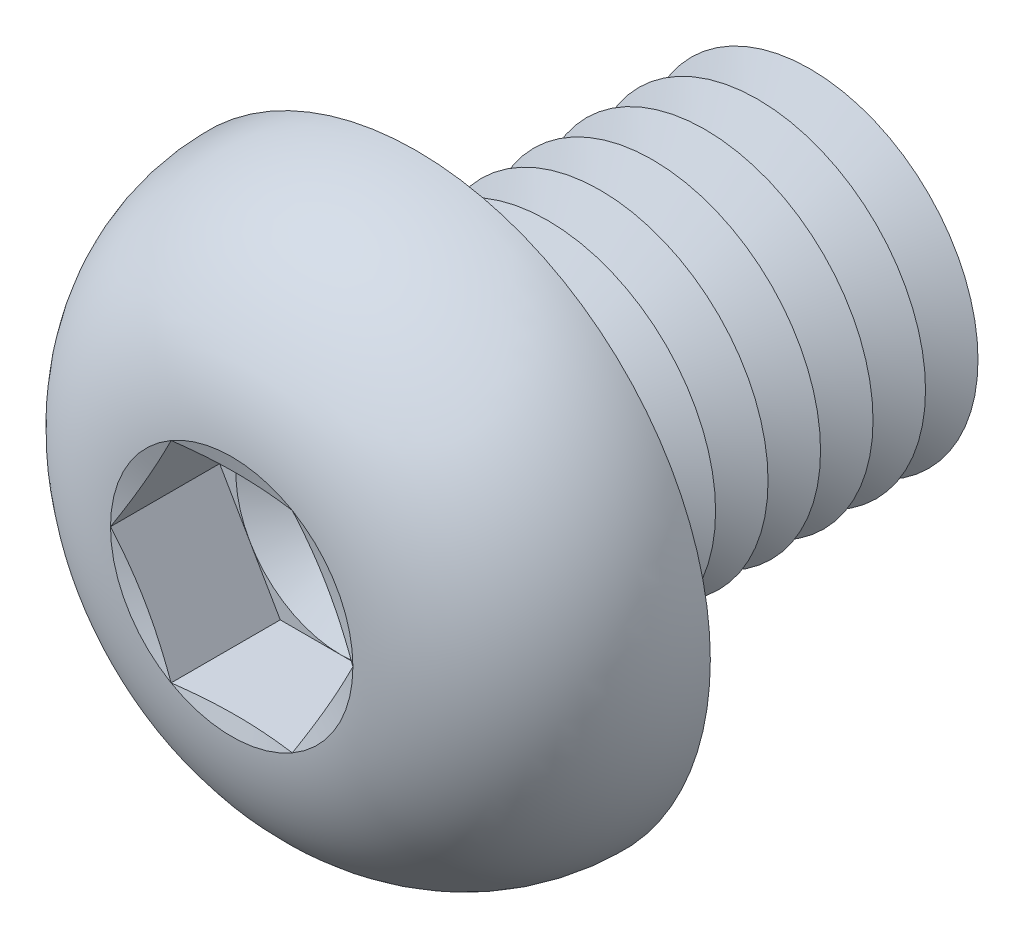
ISO-10303-21;
HEADER;
FILE_DESCRIPTION(('STEP AP214'),'2;1');
FILE_NAME('part.step','',(''),(''),'','','');
FILE_SCHEMA(('AUTOMOTIVE_DESIGN { 1 0 10303 214 1 1 1 1 }'));
ENDSEC;
DATA;
#1=APPLICATION_CONTEXT('core data for automotive mechanical design processes');
#2=APPLICATION_PROTOCOL_DEFINITION('international standard','automotive_design',2000,#1);
#3=PRODUCT_CONTEXT('',#1,'mechanical');
#4=PRODUCT('Part','Part','',(#3));
#5=PRODUCT_RELATED_PRODUCT_CATEGORY('part','',(#4));
#6=PRODUCT_DEFINITION_FORMATION('','',#4);
#7=PRODUCT_DEFINITION_CONTEXT('part definition',#1,'design');
#8=PRODUCT_DEFINITION('design','',#6,#7);
#9=PRODUCT_DEFINITION_SHAPE('','',#8);
#10=(LENGTH_UNIT() NAMED_UNIT(*) SI_UNIT(.MILLI.,.METRE.));
#11=(NAMED_UNIT(*) PLANE_ANGLE_UNIT() SI_UNIT($,.RADIAN.));
#12=(NAMED_UNIT(*) SI_UNIT($,.STERADIAN.) SOLID_ANGLE_UNIT());
#13=UNCERTAINTY_MEASURE_WITH_UNIT(LENGTH_MEASURE(1.E-05),#10,'distance_accuracy_value','');
#14=(GEOMETRIC_REPRESENTATION_CONTEXT(3) GLOBAL_UNCERTAINTY_ASSIGNED_CONTEXT((#13)) GLOBAL_UNIT_ASSIGNED_CONTEXT((#10,
#11,#12)) REPRESENTATION_CONTEXT('',''));
#15=CARTESIAN_POINT('',(0.,0.,0.));
#16=DIRECTION('',(0.,0.,1.));
#17=DIRECTION('',(1.,0.,0.));
#18=AXIS2_PLACEMENT_3D('',#15,#16,#17);
#19=CARTESIAN_POINT('',(0.,0.,1.8));
#20=DIRECTION('',(0.,0.,1.));
#21=DIRECTION('',(1.,0.,0.));
#22=AXIS2_PLACEMENT_3D('',#19,#20,#21);
#23=PLANE('',#22);
#24=CARTESIAN_POINT('',(0.,0.,1.8));
#25=DIRECTION('',(0.,0.,1.));
#26=DIRECTION('',(1.,0.,0.));
#27=AXIS2_PLACEMENT_3D('',#24,#25,#26);
#28=CIRCLE('',#27,2.49999883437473);
#29=CARTESIAN_POINT('',(2.1650625,1.24999941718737,1.8));
#30=VERTEX_POINT('',#29);
#31=CARTESIAN_POINT('',(0.,2.49999883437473,1.8));
#32=VERTEX_POINT('',#31);
#33=EDGE_CURVE('E118',#30,#32,#28,.T.);
#34=ORIENTED_EDGE('',*,*,#33,.F.);
#35=DIRECTION('',(-0.5,0.866025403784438,0.));
#36=VECTOR('',#35,1.);
#37=CARTESIAN_POINT('',(2.88675000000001,0.,1.8));
#38=LINE('',#37,#36);
#39=CARTESIAN_POINT('',(1.443375,2.49999883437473,1.8));
#40=VERTEX_POINT('',#39);
#41=EDGE_CURVE('E125',#30,#40,#38,.T.);
#42=ORIENTED_EDGE('',*,*,#41,.T.);
#43=DIRECTION('',(-1.,0.,0.));
#44=VECTOR('',#43,1.);
#45=CARTESIAN_POINT('',(1.443375,2.49999883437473,1.8));
#46=LINE('',#45,#44);
#47=EDGE_CURVE('E136',#40,#32,#46,.T.);
#48=ORIENTED_EDGE('',*,*,#47,.T.);
#49=EDGE_LOOP('',(#34,#42,#48));
#50=FACE_BOUND('',#49,.T.);
#51=ADVANCED_FACE('F39',(#50),#23,.T.);
#52=CARTESIAN_POINT('',(0.,0.,1.8));
#53=DIRECTION('',(0.,0.,1.));
#54=DIRECTION('',(1.,0.,0.));
#55=AXIS2_PLACEMENT_3D('',#52,#53,#54);
#56=CIRCLE('',#55,2.49999883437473);
#57=CARTESIAN_POINT('',(-2.1650625,1.24999941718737,1.8));
#58=VERTEX_POINT('',#57);
#59=EDGE_CURVE('E11',#32,#58,#56,.T.);
#60=ORIENTED_EDGE('',*,*,#59,.F.);
#61=CARTESIAN_POINT('',(-1.443375,2.49999883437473,1.8));
#62=VERTEX_POINT('',#61);
#63=EDGE_CURVE('E131',#32,#62,#46,.T.);
#64=ORIENTED_EDGE('',*,*,#63,.T.);
#65=DIRECTION('',(-0.5,-0.866025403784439,0.));
#66=VECTOR('',#65,1.);
#67=CARTESIAN_POINT('',(-1.443375,2.49999883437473,1.8));
#68=LINE('',#67,#66);
#69=EDGE_CURVE('E134',#62,#58,#68,.T.);
#70=ORIENTED_EDGE('',*,*,#69,.T.);
#71=EDGE_LOOP('',(#60,#64,#70));
#72=FACE_BOUND('',#71,.T.);
#73=ADVANCED_FACE('F130',(#72),#23,.T.);
#74=CARTESIAN_POINT('',(-2.1650625,-1.24999941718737,1.8));
#75=VERTEX_POINT('',#74);
#76=EDGE_CURVE('E49',#58,#75,#56,.T.);
#77=ORIENTED_EDGE('',*,*,#76,.F.);
#78=CARTESIAN_POINT('',(-2.88675000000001,0.,1.8));
#79=VERTEX_POINT('',#78);
#80=EDGE_CURVE('E143',#58,#79,#68,.T.);
#81=ORIENTED_EDGE('',*,*,#80,.T.);
#82=DIRECTION('',(0.5,-0.866025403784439,0.));
#83=VECTOR('',#82,1.);
#84=CARTESIAN_POINT('',(-2.88675000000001,0.,1.8));
#85=LINE('',#84,#83);
#86=EDGE_CURVE('E152',#79,#75,#85,.T.);
#87=ORIENTED_EDGE('',*,*,#86,.T.);
#88=EDGE_LOOP('',(#77,#81,#87));
#89=FACE_BOUND('',#88,.T.);
#90=ADVANCED_FACE('F332',(#89),#23,.T.);
#91=CARTESIAN_POINT('',(0.,-2.49999883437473,1.8));
#92=VERTEX_POINT('',#91);
#93=EDGE_CURVE('E316',#75,#92,#56,.T.);
#94=ORIENTED_EDGE('',*,*,#93,.F.);
#95=CARTESIAN_POINT('',(-1.443375,-2.49999883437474,1.8));
#96=VERTEX_POINT('',#95);
#97=EDGE_CURVE('E151',#75,#96,#85,.T.);
#98=ORIENTED_EDGE('',*,*,#97,.T.);
#99=DIRECTION('',(1.,0.,0.));
#100=VECTOR('',#99,1.);
#101=CARTESIAN_POINT('',(-1.443375,-2.49999883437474,1.8));
#102=LINE('',#101,#100);
#103=EDGE_CURVE('E157',#96,#92,#102,.T.);
#104=ORIENTED_EDGE('',*,*,#103,.T.);
#105=EDGE_LOOP('',(#94,#98,#104));
#106=FACE_BOUND('',#105,.T.);
#107=ADVANCED_FACE('F325',(#106),#23,.T.);
#108=CARTESIAN_POINT('',(2.16506250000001,-1.24999941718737,1.8));
#109=VERTEX_POINT('',#108);
#110=EDGE_CURVE('E56',#92,#109,#56,.T.);
#111=ORIENTED_EDGE('',*,*,#110,.F.);
#112=CARTESIAN_POINT('',(1.443375,-2.49999883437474,1.8));
#113=VERTEX_POINT('',#112);
#114=EDGE_CURVE('E156',#92,#113,#102,.T.);
#115=ORIENTED_EDGE('',*,*,#114,.T.);
#116=DIRECTION('',(0.5,0.866025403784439,0.));
#117=VECTOR('',#116,1.);
#118=CARTESIAN_POINT('',(1.443375,-2.49999883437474,1.8));
#119=LINE('',#118,#117);
#120=EDGE_CURVE('E162',#113,#109,#119,.T.);
#121=ORIENTED_EDGE('',*,*,#120,.T.);
#122=EDGE_LOOP('',(#111,#115,#121));
#123=FACE_BOUND('',#122,.T.);
#124=ADVANCED_FACE('F401',(#123),#23,.T.);
#125=CARTESIAN_POINT('',(0.,0.,4.4));
#126=DIRECTION('',(0.,0.,1.));
#127=DIRECTION('',(0.,-1.,0.));
#128=AXIS2_PLACEMENT_3D('',#125,#126,#127);
#129=CONICAL_SURFACE('',#128,2.88675000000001,1.30899693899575);
#130=CARTESIAN_POINT('',(2.88686547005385,-0.000200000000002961,4.40003094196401));
#131=CARTESIAN_POINT('',(2.82691617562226,0.103635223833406,4.3839595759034));
#132=CARTESIAN_POINT('',(2.7668581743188,0.20765873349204,4.36936933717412));
#133=CARTESIAN_POINT('',(2.64653003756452,0.416073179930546,4.3437355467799));
#134=CARTESIAN_POINT('',(2.58625982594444,0.520464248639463,4.33269343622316));
#135=CARTESIAN_POINT('',(2.46587274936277,0.728980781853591,4.31480063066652));
#136=CARTESIAN_POINT('',(2.40575669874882,0.833104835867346,4.3079285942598));
#137=CARTESIAN_POINT('',(2.28544792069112,1.0414857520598,4.29871388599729));
#138=CARTESIAN_POINT('',(2.22525521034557,1.14574258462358,4.29637033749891));
#139=CARTESIAN_POINT('',(2.10486978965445,1.35425624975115,4.29637033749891));
#140=CARTESIAN_POINT('',(2.04467707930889,1.45851308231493,4.29871388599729));
#141=CARTESIAN_POINT('',(1.9243683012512,1.66689399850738,4.3079285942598));
#142=CARTESIAN_POINT('',(1.86425225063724,1.77101805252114,4.31480063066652));
#143=CARTESIAN_POINT('',(1.74386517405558,1.97953458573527,4.33269343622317));
#144=CARTESIAN_POINT('',(1.68359496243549,2.08392565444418,4.3437355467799));
#145=CARTESIAN_POINT('',(1.56326682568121,2.29234010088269,4.36936933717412));
#146=CARTESIAN_POINT('',(1.50320882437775,2.39636361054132,4.3839595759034));
#147=CARTESIAN_POINT('',(1.44325952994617,2.50019883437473,4.40003094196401));
#148=B_SPLINE_CURVE_WITH_KNOTS('',3,(#130,#131,#132,#133,#134,#135,#136,#137,#138,#139,#140,
#141,#142,#143,#144,#145,#146,#147),.UNSPECIFIED.,.F.,.F.,(4,2,2,2,2,2,2,2,4),(0.,
0.362931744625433,0.726010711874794,1.08721550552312,1.44835036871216,1.8094852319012,
2.17069002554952,2.53376899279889,2.89670073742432),.UNSPECIFIED.);
#149=CARTESIAN_POINT('',(2.88675000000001,0.,4.4));
#150=VERTEX_POINT('',#149);
#151=CARTESIAN_POINT('',(1.44337499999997,2.49999883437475,4.4));
#152=VERTEX_POINT('',#151);
#153=EDGE_CURVE('E221',#150,#152,#148,.T.);
#154=ORIENTED_EDGE('',*,*,#153,.F.);
#155=CARTESIAN_POINT('',(0.,0.,4.4));
#156=DIRECTION('',(0.,0.,-1.));
#157=DIRECTION('',(0.,1.,0.));
#158=AXIS2_PLACEMENT_3D('',#155,#156,#157);
#159=CIRCLE('',#158,2.88675000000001);
#160=EDGE_CURVE('E300',#152,#150,#159,.T.);
#161=ORIENTED_EDGE('',*,*,#160,.F.);
#162=EDGE_LOOP('',(#154,#161));
#163=FACE_BOUND('',#162,.T.);
#164=ADVANCED_FACE('F405',(#163),#129,.F.);
#165=CARTESIAN_POINT('',(1.44325952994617,-2.50019883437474,4.400030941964));
#166=CARTESIAN_POINT('',(1.50320882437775,-2.39636361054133,4.3839595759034));
#167=CARTESIAN_POINT('',(1.56326682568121,-2.2923401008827,4.36936933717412));
#168=CARTESIAN_POINT('',(1.68359496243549,-2.08392565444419,4.3437355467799));
#169=CARTESIAN_POINT('',(1.74386517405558,-1.97953458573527,4.33269343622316));
#170=CARTESIAN_POINT('',(1.86425225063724,-1.77101805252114,4.31480063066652));
#171=CARTESIAN_POINT('',(1.9243683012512,-1.66689399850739,4.3079285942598));
#172=CARTESIAN_POINT('',(2.04467707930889,-1.45851308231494,4.29871388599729));
#173=CARTESIAN_POINT('',(2.10486978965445,-1.35425624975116,4.29637033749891));
#174=CARTESIAN_POINT('',(2.22525521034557,-1.14574258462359,4.29637033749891));
#175=CARTESIAN_POINT('',(2.28544792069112,-1.0414857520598,4.29871388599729));
#176=CARTESIAN_POINT('',(2.40575669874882,-0.833104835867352,4.3079285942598));
#177=CARTESIAN_POINT('',(2.46587274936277,-0.728980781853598,4.31480063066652));
#178=CARTESIAN_POINT('',(2.58625982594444,-0.520464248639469,4.33269343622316));
#179=CARTESIAN_POINT('',(2.64653003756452,-0.416073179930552,4.3437355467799));
#180=CARTESIAN_POINT('',(2.7668581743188,-0.207658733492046,4.36936933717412));
#181=CARTESIAN_POINT('',(2.82691617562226,-0.103635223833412,4.3839595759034));
#182=CARTESIAN_POINT('',(2.88686547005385,0.000199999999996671,4.40003094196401));
#183=B_SPLINE_CURVE_WITH_KNOTS('',3,(#165,#166,#167,#168,#169,#170,#171,#172,#173,#174,#175,
#176,#177,#178,#179,#180,#181,#182),.UNSPECIFIED.,.F.,.F.,(4,2,2,2,2,2,2,2,4),(0.,
0.362931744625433,0.726010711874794,1.08721550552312,1.44835036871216,1.8094852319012,
2.17069002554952,2.53376899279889,2.89670073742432),.UNSPECIFIED.);
#184=CARTESIAN_POINT('',(1.443375,-2.49999883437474,4.4));
#185=VERTEX_POINT('',#184);
#186=EDGE_CURVE('E230',#185,#150,#183,.T.);
#187=ORIENTED_EDGE('',*,*,#186,.F.);
#188=EDGE_CURVE('E304',#150,#185,#159,.T.);
#189=ORIENTED_EDGE('',*,*,#188,.F.);
#190=EDGE_LOOP('',(#187,#189));
#191=FACE_BOUND('',#190,.T.);
#192=ADVANCED_FACE('F367',(#191),#129,.F.);
#193=CARTESIAN_POINT('',(-4.35611719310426,-2.49999883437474,4.97227902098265));
#194=CARTESIAN_POINT('',(-4.25066509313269,-2.49999883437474,4.94777440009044));
#195=CARTESIAN_POINT('',(-4.14516541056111,-2.49999883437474,4.92347459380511));
#196=CARTESIAN_POINT('',(-3.93405094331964,-2.49999883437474,4.87537247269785));
#197=CARTESIAN_POINT('',(-3.8284361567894,-2.49999883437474,4.85157016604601));
#198=CARTESIAN_POINT('',(-3.51135349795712,-2.49999883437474,4.78103338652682));
#199=CARTESIAN_POINT('',(-3.29968815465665,-2.49999883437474,4.73517861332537));
#200=CARTESIAN_POINT('',(-2.8736552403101,-2.49999883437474,4.6464558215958));
#201=CARTESIAN_POINT('',(-2.65928093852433,-2.49999883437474,4.60361983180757));
#202=CARTESIAN_POINT('',(-2.22952626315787,-2.49999883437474,4.52311285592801));
#203=CARTESIAN_POINT('',(-2.01414580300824,-2.49999883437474,4.48544232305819));
#204=CARTESIAN_POINT('',(-1.58798319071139,-2.49999883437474,4.4187655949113));
#205=CARTESIAN_POINT('',(-1.37723418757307,-2.49999883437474,4.3895526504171));
#206=CARTESIAN_POINT('',(-0.954530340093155,-2.49999883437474,4.34171384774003));
#207=CARTESIAN_POINT('',(-0.742575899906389,-2.49999883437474,4.32308463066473));
#208=CARTESIAN_POINT('',(-0.424544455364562,-2.49999883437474,4.30539140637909));
#209=CARTESIAN_POINT('',(-0.318745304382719,-2.49999883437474,4.30120018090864));
#210=CARTESIAN_POINT('',(-0.107062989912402,-2.49999883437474,4.29638997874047));
#211=CARTESIAN_POINT('',(-0.00117982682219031,-2.49999883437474,4.29577098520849));
#212=CARTESIAN_POINT('',(0.210552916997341,-2.49999883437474,4.29814378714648));
#213=CARTESIAN_POINT('',(0.316402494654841,-2.49999883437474,4.30113585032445));
#214=CARTESIAN_POINT('',(0.52794413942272,-2.49999883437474,4.31057322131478));
#215=CARTESIAN_POINT('',(0.633636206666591,-2.49999883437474,4.31701852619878));
#216=CARTESIAN_POINT('',(0.890304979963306,-2.49999883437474,4.33652018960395));
#217=CARTESIAN_POINT('',(1.0411561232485,-2.49999883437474,4.35122885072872));
#218=CARTESIAN_POINT('',(1.34222474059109,-2.49999883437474,4.38593609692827));
#219=CARTESIAN_POINT('',(1.49244223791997,-2.49999883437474,4.40593448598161));
#220=CARTESIAN_POINT('',(1.79273634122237,-2.49999883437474,4.450113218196));
#221=CARTESIAN_POINT('',(1.94281100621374,-2.49999883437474,4.47430656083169));
#222=CARTESIAN_POINT('',(2.24242097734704,-2.49999883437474,4.52583552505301));
#223=CARTESIAN_POINT('',(2.39195625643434,-2.49999883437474,4.55317130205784));
#224=CARTESIAN_POINT('',(2.69364402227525,-2.49999883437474,4.61079781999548));
#225=CARTESIAN_POINT('',(2.84578703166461,-2.49999883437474,4.64113779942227));
#226=CARTESIAN_POINT('',(3.14969016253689,-2.49999883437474,4.70367638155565));
#227=CARTESIAN_POINT('',(3.30145027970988,-2.49999883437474,4.73587500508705));
#228=CARTESIAN_POINT('',(3.6038376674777,-2.49999883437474,4.80150275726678));
#229=CARTESIAN_POINT('',(3.75446660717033,-2.49999883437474,4.83492423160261));
#230=CARTESIAN_POINT('',(4.0554675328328,-2.49999883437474,4.90285814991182));
#231=CARTESIAN_POINT('',(4.20583953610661,-2.49999883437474,4.93737051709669));
#232=CARTESIAN_POINT('',(4.35611719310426,-2.49999883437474,4.97227902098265));
#233=B_SPLINE_CURVE_WITH_KNOTS('',3,(#193,#194,#195,#196,#197,#198,#199,#200,#201,#202,#203,
#204,#205,#206,#207,#208,#209,#210,#211,#212,#213,#214,#215,#216,#217,#218,#219,#220,#221,#222,
#223,#224,#225,#226,#227,#228,#229,#230,#231,#232),.UNSPECIFIED.,.F.,.F.,(4,2,2,2,2,2,2,2,2,2,2,
2,2,2,2,2,2,2,2,4),(0.,0.324785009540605,0.649575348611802,1.29928181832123,1.95507889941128,
2.61093348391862,3.2490528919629,3.8869696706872,4.20456300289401,4.52215483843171,
4.83977022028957,5.15738533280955,5.61196030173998,6.06651842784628,6.5225111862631,
6.97852650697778,7.4439273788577,7.90933346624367,8.37220553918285,8.83504510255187),.UNSPECIFIED.);
#234=CARTESIAN_POINT('',(-1.443375,-2.49999883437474,4.4));
#235=VERTEX_POINT('',#234);
#236=EDGE_CURVE('E345',#235,#185,#233,.T.);
#237=ORIENTED_EDGE('',*,*,#236,.F.);
#238=EDGE_CURVE('E358',#185,#235,#159,.T.);
#239=ORIENTED_EDGE('',*,*,#238,.F.);
#240=EDGE_LOOP('',(#237,#239));
#241=FACE_BOUND('',#240,.T.);
#242=ADVANCED_FACE('F373',(#241),#129,.F.);
#243=CARTESIAN_POINT('',(-2.88686547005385,0.000199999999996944,4.40003094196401));
#244=CARTESIAN_POINT('',(-2.82691617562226,-0.103635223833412,4.3839595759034));
#245=CARTESIAN_POINT('',(-2.7668581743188,-0.207658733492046,4.36936933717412));
#246=CARTESIAN_POINT('',(-2.64653003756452,-0.416073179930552,4.3437355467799));
#247=CARTESIAN_POINT('',(-2.58625982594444,-0.520464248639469,4.33269343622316));
#248=CARTESIAN_POINT('',(-2.46587274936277,-0.728980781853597,4.31480063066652));
#249=CARTESIAN_POINT('',(-2.40575669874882,-0.833104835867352,4.3079285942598));
#250=CARTESIAN_POINT('',(-2.28544792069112,-1.0414857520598,4.29871388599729));
#251=CARTESIAN_POINT('',(-2.22525521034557,-1.14574258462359,4.29637033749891));
#252=CARTESIAN_POINT('',(-2.10486978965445,-1.35425624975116,4.29637033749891));
#253=CARTESIAN_POINT('',(-2.04467707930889,-1.45851308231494,4.29871388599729));
#254=CARTESIAN_POINT('',(-1.9243683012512,-1.66689399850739,4.3079285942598));
#255=CARTESIAN_POINT('',(-1.86425225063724,-1.77101805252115,4.31480063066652));
#256=CARTESIAN_POINT('',(-1.74386517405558,-1.97953458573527,4.33269343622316));
#257=CARTESIAN_POINT('',(-1.68359496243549,-2.08392565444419,4.3437355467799));
#258=CARTESIAN_POINT('',(-1.56326682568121,-2.2923401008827,4.36936933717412));
#259=CARTESIAN_POINT('',(-1.50320882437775,-2.39636361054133,4.3839595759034));
#260=CARTESIAN_POINT('',(-1.44325952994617,-2.50019883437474,4.400030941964));
#261=B_SPLINE_CURVE_WITH_KNOTS('',3,(#243,#244,#245,#246,#247,#248,#249,#250,#251,#252,#253,
#254,#255,#256,#257,#258,#259,#260),.UNSPECIFIED.,.F.,.F.,(4,2,2,2,2,2,2,2,4),(0.,
0.362931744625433,0.726010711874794,1.08721550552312,1.44835036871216,1.8094852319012,
2.17069002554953,2.53376899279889,2.89670073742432),.UNSPECIFIED.);
#262=CARTESIAN_POINT('',(-2.88675000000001,0.,4.4));
#263=VERTEX_POINT('',#262);
#264=EDGE_CURVE('E337',#263,#235,#261,.T.);
#265=ORIENTED_EDGE('',*,*,#264,.F.);
#266=EDGE_CURVE('E343',#235,#263,#159,.T.);
#267=ORIENTED_EDGE('',*,*,#266,.F.);
#268=EDGE_LOOP('',(#265,#267));
#269=FACE_BOUND('',#268,.T.);
#270=ADVANCED_FACE('F341',(#269),#129,.F.);
#271=CARTESIAN_POINT('',(-1.44325952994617,2.50019883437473,4.40003094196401));
#272=CARTESIAN_POINT('',(-1.50320882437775,2.39636361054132,4.3839595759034));
#273=CARTESIAN_POINT('',(-1.56326682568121,2.29234010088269,4.36936933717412));
#274=CARTESIAN_POINT('',(-1.68359496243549,2.08392565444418,4.3437355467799));
#275=CARTESIAN_POINT('',(-1.74386517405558,1.97953458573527,4.33269343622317));
#276=CARTESIAN_POINT('',(-1.86425225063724,1.77101805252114,4.31480063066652));
#277=CARTESIAN_POINT('',(-1.9243683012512,1.66689399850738,4.3079285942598));
#278=CARTESIAN_POINT('',(-2.04467707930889,1.45851308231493,4.29871388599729));
#279=CARTESIAN_POINT('',(-2.10486978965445,1.35425624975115,4.29637033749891));
#280=CARTESIAN_POINT('',(-2.22525521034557,1.14574258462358,4.29637033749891));
#281=CARTESIAN_POINT('',(-2.28544792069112,1.0414857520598,4.29871388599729));
#282=CARTESIAN_POINT('',(-2.40575669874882,0.833104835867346,4.3079285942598));
#283=CARTESIAN_POINT('',(-2.46587274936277,0.728980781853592,4.31480063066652));
#284=CARTESIAN_POINT('',(-2.58625982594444,0.520464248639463,4.33269343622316));
#285=CARTESIAN_POINT('',(-2.64653003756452,0.416073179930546,4.3437355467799));
#286=CARTESIAN_POINT('',(-2.7668581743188,0.20765873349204,4.36936933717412));
#287=CARTESIAN_POINT('',(-2.82691617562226,0.103635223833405,4.3839595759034));
#288=CARTESIAN_POINT('',(-2.88686547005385,-0.000200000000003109,4.40003094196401));
#289=B_SPLINE_CURVE_WITH_KNOTS('',3,(#271,#272,#273,#274,#275,#276,#277,#278,#279,#280,#281,
#282,#283,#284,#285,#286,#287,#288),.UNSPECIFIED.,.F.,.F.,(4,2,2,2,2,2,2,2,4),(0.,
0.362931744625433,0.726010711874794,1.08721550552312,1.44835036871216,1.8094852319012,
2.17069002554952,2.53376899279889,2.89670073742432),.UNSPECIFIED.);
#290=CARTESIAN_POINT('',(-1.443375,2.49999883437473,4.4));
#291=VERTEX_POINT('',#290);
#292=EDGE_CURVE('E195',#291,#263,#289,.T.);
#293=ORIENTED_EDGE('',*,*,#292,.F.);
#294=EDGE_CURVE('E348',#263,#291,#159,.T.);
#295=ORIENTED_EDGE('',*,*,#294,.F.);
#296=EDGE_LOOP('',(#293,#295));
#297=FACE_BOUND('',#296,.T.);
#298=ADVANCED_FACE('F349',(#297),#129,.F.);
#299=CARTESIAN_POINT('',(0.,0.,-5.625));
#300=DIRECTION('',(0.,0.,1.));
#301=DIRECTION('',(0.,-1.,0.));
#302=AXIS2_PLACEMENT_3D('',#299,#300,#301);
#303=CONICAL_SURFACE('',#302,3.99999999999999,1.0471975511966);
#304=CARTESIAN_POINT('',(0.,0.,-6.25));
#305=DIRECTION('',(0.,0.,1.));
#306=DIRECTION('',(0.,-1.,0.));
#307=AXIS2_PLACEMENT_3D('',#304,#305,#306);
#308=CIRCLE('',#307,2.91746824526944);
#309=CARTESIAN_POINT('',(0.,-2.91746824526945,-6.25));
#310=VERTEX_POINT('',#309);
#311=EDGE_CURVE('E271',#310,#310,#308,.T.);
#312=ORIENTED_EDGE('',*,*,#311,.T.);
#313=EDGE_LOOP('',(#312));
#314=FACE_BOUND('',#313,.T.);
#315=CARTESIAN_POINT('',(0.,0.,-5.625));
#316=DIRECTION('',(0.,0.,1.));
#317=DIRECTION('',(0.,-1.,0.));
#318=AXIS2_PLACEMENT_3D('',#315,#316,#317);
#319=CIRCLE('',#318,3.99999999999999);
#320=CARTESIAN_POINT('',(0.,-4.,-5.625));
#321=VERTEX_POINT('',#320);
#322=EDGE_CURVE('E267',#321,#321,#319,.T.);
#323=ORIENTED_EDGE('',*,*,#322,.F.);
#324=EDGE_LOOP('',(#323));
#325=FACE_BOUND('',#324,.T.);
#326=ADVANCED_FACE('F431',(#314,#325),#303,.T.);
#327=CARTESIAN_POINT('',(0.,0.,-6.25));
#328=DIRECTION('',(0.,0.,-1.));
#329=DIRECTION('',(0.,1.,0.));
#330=AXIS2_PLACEMENT_3D('',#327,#328,#329);
#331=CONICAL_SURFACE('',#330,2.91746824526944,1.0471975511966);
#332=CARTESIAN_POINT('',(0.,0.,-6.875));
#333=DIRECTION('',(0.,0.,1.));
#334=DIRECTION('',(0.,-1.,0.));
#335=AXIS2_PLACEMENT_3D('',#332,#333,#334);
#336=CIRCLE('',#335,3.99999999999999);
#337=CARTESIAN_POINT('',(0.,-3.99999999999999,-6.875));
#338=VERTEX_POINT('',#337);
#339=EDGE_CURVE('E275',#338,#338,#336,.T.);
#340=ORIENTED_EDGE('',*,*,#339,.T.);
#341=EDGE_LOOP('',(#340));
#342=FACE_BOUND('',#341,.T.);
#343=ORIENTED_EDGE('',*,*,#311,.F.);
#344=EDGE_LOOP('',(#343));
#345=FACE_BOUND('',#344,.T.);
#346=ADVANCED_FACE('F436',(#342,#345),#331,.T.);
#347=CARTESIAN_POINT('',(0.,3.99999999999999,-9.99999999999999));
#348=DIRECTION('',(0.,0.,-1.));
#349=DIRECTION('',(0.,1.,0.));
#350=AXIS2_PLACEMENT_3D('',#347,#348,#349);
#351=PLANE('',#350);
#352=CARTESIAN_POINT('',(0.,0.,-10.));
#353=DIRECTION('',(0.,0.,1.));
#354=DIRECTION('',(0.,-1.,0.));
#355=AXIS2_PLACEMENT_3D('',#352,#353,#354);
#356=CIRCLE('',#355,2.91746824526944);
#357=CARTESIAN_POINT('',(0.,-2.91746824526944,-10.));
#358=VERTEX_POINT('',#357);
#359=EDGE_CURVE('E295',#358,#358,#356,.T.);
#360=ORIENTED_EDGE('',*,*,#359,.F.);
#361=EDGE_LOOP('',(#360));
#362=FACE_BOUND('',#361,.T.);
#363=ADVANCED_FACE('F603',(#362),#351,.T.);
#364=CARTESIAN_POINT('',(0.,0.,-9.375));
#365=DIRECTION('',(0.,0.,1.));
#366=DIRECTION('',(0.,-1.,0.));
#367=AXIS2_PLACEMENT_3D('',#364,#365,#366);
#368=CONICAL_SURFACE('',#367,3.99999999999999,1.0471975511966);
#369=ORIENTED_EDGE('',*,*,#359,.T.);
#370=EDGE_LOOP('',(#369));
#371=FACE_BOUND('',#370,.T.);
#372=CARTESIAN_POINT('',(0.,0.,-9.375));
#373=DIRECTION('',(0.,0.,1.));
#374=DIRECTION('',(0.,-1.,0.));
#375=AXIS2_PLACEMENT_3D('',#372,#373,#374);
#376=CIRCLE('',#375,3.99999999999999);
#377=CARTESIAN_POINT('',(0.,-3.99999999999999,-9.375));
#378=VERTEX_POINT('',#377);
#379=EDGE_CURVE('E291',#378,#378,#376,.T.);
#380=ORIENTED_EDGE('',*,*,#379,.F.);
#381=EDGE_LOOP('',(#380));
#382=FACE_BOUND('',#381,.T.);
#383=ADVANCED_FACE('F596',(#371,#382),#368,.T.);
#384=CARTESIAN_POINT('',(0.,0.,-8.75));
#385=DIRECTION('',(0.,0.,-1.));
#386=DIRECTION('',(0.,1.,0.));
#387=AXIS2_PLACEMENT_3D('',#384,#385,#386);
#388=CONICAL_SURFACE('',#387,2.91746824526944,1.0471975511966);
#389=ORIENTED_EDGE('',*,*,#379,.T.);
#390=EDGE_LOOP('',(#389));
#391=FACE_BOUND('',#390,.T.);
#392=CARTESIAN_POINT('',(0.,0.,-8.75));
#393=DIRECTION('',(0.,0.,1.));
#394=DIRECTION('',(0.,-1.,0.));
#395=AXIS2_PLACEMENT_3D('',#392,#393,#394);
#396=CIRCLE('',#395,2.91746824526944);
#397=CARTESIAN_POINT('',(0.,-2.91746824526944,-8.75));
#398=VERTEX_POINT('',#397);
#399=EDGE_CURVE('E287',#398,#398,#396,.T.);
#400=ORIENTED_EDGE('',*,*,#399,.F.);
#401=EDGE_LOOP('',(#400));
#402=FACE_BOUND('',#401,.T.);
#403=ADVANCED_FACE('F602',(#391,#402),#388,.T.);
#404=CARTESIAN_POINT('',(0.,0.,-8.125));
#405=DIRECTION('',(0.,0.,1.));
#406=DIRECTION('',(0.,-1.,0.));
#407=AXIS2_PLACEMENT_3D('',#404,#405,#406);
#408=CONICAL_SURFACE('',#407,3.99999999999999,1.0471975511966);
#409=ORIENTED_EDGE('',*,*,#399,.T.);
#410=EDGE_LOOP('',(#409));
#411=FACE_BOUND('',#410,.T.);
#412=CARTESIAN_POINT('',(0.,0.,-8.125));
#413=DIRECTION('',(0.,0.,1.));
#414=DIRECTION('',(0.,-1.,0.));
#415=AXIS2_PLACEMENT_3D('',#412,#413,#414);
#416=CIRCLE('',#415,3.99999999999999);
#417=CARTESIAN_POINT('',(0.,-3.99999999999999,-8.125));
#418=VERTEX_POINT('',#417);
#419=EDGE_CURVE('E283',#418,#418,#416,.T.);
#420=ORIENTED_EDGE('',*,*,#419,.F.);
#421=EDGE_LOOP('',(#420));
#422=FACE_BOUND('',#421,.T.);
#423=ADVANCED_FACE('F634',(#411,#422),#408,.T.);
#424=CARTESIAN_POINT('',(0.,0.,-7.5));
#425=DIRECTION('',(0.,0.,-1.));
#426=DIRECTION('',(0.,1.,0.));
#427=AXIS2_PLACEMENT_3D('',#424,#425,#426);
#428=CONICAL_SURFACE('',#427,2.91746824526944,1.0471975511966);
#429=ORIENTED_EDGE('',*,*,#419,.T.);
#430=EDGE_LOOP('',(#429));
#431=FACE_BOUND('',#430,.T.);
#432=CARTESIAN_POINT('',(0.,0.,-7.5));
#433=DIRECTION('',(0.,0.,1.));
#434=DIRECTION('',(0.,-1.,0.));
#435=AXIS2_PLACEMENT_3D('',#432,#433,#434);
#436=CIRCLE('',#435,2.91746824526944);
#437=CARTESIAN_POINT('',(0.,-2.91746824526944,-7.5));
#438=VERTEX_POINT('',#437);
#439=EDGE_CURVE('E279',#438,#438,#436,.T.);
#440=ORIENTED_EDGE('',*,*,#439,.F.);
#441=EDGE_LOOP('',(#440));
#442=FACE_BOUND('',#441,.T.);
#443=ADVANCED_FACE('F644',(#431,#442),#428,.T.);
#444=CARTESIAN_POINT('',(0.,0.,-6.875));
#445=DIRECTION('',(0.,0.,1.));
#446=DIRECTION('',(0.,-1.,0.));
#447=AXIS2_PLACEMENT_3D('',#444,#445,#446);
#448=CONICAL_SURFACE('',#447,3.99999999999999,1.0471975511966);
#449=ORIENTED_EDGE('',*,*,#439,.T.);
#450=EDGE_LOOP('',(#449));
#451=FACE_BOUND('',#450,.T.);
#452=ORIENTED_EDGE('',*,*,#339,.F.);
#453=EDGE_LOOP('',(#452));
#454=FACE_BOUND('',#453,.T.);
#455=ADVANCED_FACE('F654',(#451,#454),#448,.T.);
#456=CARTESIAN_POINT('',(0.,0.,-4.375));
#457=DIRECTION('',(0.,0.,1.));
#458=DIRECTION('',(0.,-1.,0.));
#459=AXIS2_PLACEMENT_3D('',#456,#457,#458);
#460=CONICAL_SURFACE('',#459,3.99999999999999,1.0471975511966);
#461=CARTESIAN_POINT('',(0.,0.,-5.));
#462=DIRECTION('',(0.,0.,1.));
#463=DIRECTION('',(0.,-1.,0.));
#464=AXIS2_PLACEMENT_3D('',#461,#462,#463);
#465=CIRCLE('',#464,2.91746824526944);
#466=CARTESIAN_POINT('',(0.,-2.91746824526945,-5.));
#467=VERTEX_POINT('',#466);
#468=EDGE_CURVE('E263',#467,#467,#465,.T.);
#469=ORIENTED_EDGE('',*,*,#468,.T.);
#470=EDGE_LOOP('',(#469));
#471=FACE_BOUND('',#470,.T.);
#472=CARTESIAN_POINT('',(0.,0.,-4.375));
#473=DIRECTION('',(0.,0.,1.));
#474=DIRECTION('',(0.,-1.,0.));
#475=AXIS2_PLACEMENT_3D('',#472,#473,#474);
#476=CIRCLE('',#475,3.99999999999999);
#477=CARTESIAN_POINT('',(0.,-4.,-4.375));
#478=VERTEX_POINT('',#477);
#479=EDGE_CURVE('E259',#478,#478,#476,.T.);
#480=ORIENTED_EDGE('',*,*,#479,.F.);
#481=EDGE_LOOP('',(#480));
#482=FACE_BOUND('',#481,.T.);
#483=ADVANCED_FACE('F664',(#471,#482),#460,.T.);
#484=CARTESIAN_POINT('',(0.,0.,-5.));
#485=DIRECTION('',(0.,0.,-1.));
#486=DIRECTION('',(0.,1.,0.));
#487=AXIS2_PLACEMENT_3D('',#484,#485,#486);
#488=CONICAL_SURFACE('',#487,2.91746824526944,1.0471975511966);
#489=ORIENTED_EDGE('',*,*,#322,.T.);
#490=EDGE_LOOP('',(#489));
#491=FACE_BOUND('',#490,.T.);
#492=ORIENTED_EDGE('',*,*,#468,.F.);
#493=EDGE_LOOP('',(#492));
#494=FACE_BOUND('',#493,.T.);
#495=ADVANCED_FACE('F674',(#491,#494),#488,.T.);
#496=CARTESIAN_POINT('',(0.,0.,-3.125));
#497=DIRECTION('',(0.,0.,1.));
#498=DIRECTION('',(0.,-1.,0.));
#499=AXIS2_PLACEMENT_3D('',#496,#497,#498);
#500=CONICAL_SURFACE('',#499,3.99999999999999,1.0471975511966);
#501=CARTESIAN_POINT('',(0.,0.,-3.75));
#502=DIRECTION('',(0.,0.,1.));
#503=DIRECTION('',(0.,-1.,0.));
#504=AXIS2_PLACEMENT_3D('',#501,#502,#503);
#505=CIRCLE('',#504,2.91746824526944);
#506=CARTESIAN_POINT('',(0.,-2.91746824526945,-3.75));
#507=VERTEX_POINT('',#506);
#508=EDGE_CURVE('E255',#507,#507,#505,.T.);
#509=ORIENTED_EDGE('',*,*,#508,.T.);
#510=EDGE_LOOP('',(#509));
#511=FACE_BOUND('',#510,.T.);
#512=CARTESIAN_POINT('',(0.,0.,-3.125));
#513=DIRECTION('',(0.,0.,1.));
#514=DIRECTION('',(0.,-1.,0.));
#515=AXIS2_PLACEMENT_3D('',#512,#513,#514);
#516=CIRCLE('',#515,3.99999999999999);
#517=CARTESIAN_POINT('',(0.,-4.,-3.125));
#518=VERTEX_POINT('',#517);
#519=EDGE_CURVE('E251',#518,#518,#516,.T.);
#520=ORIENTED_EDGE('',*,*,#519,.F.);
#521=EDGE_LOOP('',(#520));
#522=FACE_BOUND('',#521,.T.);
#523=ADVANCED_FACE('F684',(#511,#522),#500,.T.);
#524=CARTESIAN_POINT('',(0.,0.,-3.75));
#525=DIRECTION('',(0.,0.,-1.));
#526=DIRECTION('',(0.,1.,0.));
#527=AXIS2_PLACEMENT_3D('',#524,#525,#526);
#528=CONICAL_SURFACE('',#527,2.91746824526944,1.0471975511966);
#529=ORIENTED_EDGE('',*,*,#479,.T.);
#530=EDGE_LOOP('',(#529));
#531=FACE_BOUND('',#530,.T.);
#532=ORIENTED_EDGE('',*,*,#508,.F.);
#533=EDGE_LOOP('',(#532));
#534=FACE_BOUND('',#533,.T.);
#535=ADVANCED_FACE('F694',(#531,#534),#528,.T.);
#536=CARTESIAN_POINT('',(0.,0.,-1.875));
#537=DIRECTION('',(0.,0.,1.));
#538=DIRECTION('',(0.,-1.,0.));
#539=AXIS2_PLACEMENT_3D('',#536,#537,#538);
#540=CONICAL_SURFACE('',#539,3.99999999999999,1.0471975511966);
#541=CARTESIAN_POINT('',(0.,0.,-2.5));
#542=DIRECTION('',(0.,0.,1.));
#543=DIRECTION('',(0.,-1.,0.));
#544=AXIS2_PLACEMENT_3D('',#541,#542,#543);
#545=CIRCLE('',#544,2.91746824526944);
#546=CARTESIAN_POINT('',(0.,-2.91746824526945,-2.5));
#547=VERTEX_POINT('',#546);
#548=EDGE_CURVE('E247',#547,#547,#545,.T.);
#549=ORIENTED_EDGE('',*,*,#548,.T.);
#550=EDGE_LOOP('',(#549));
#551=FACE_BOUND('',#550,.T.);
#552=CARTESIAN_POINT('',(0.,0.,-1.875));
#553=DIRECTION('',(0.,0.,1.));
#554=DIRECTION('',(0.,-1.,0.));
#555=AXIS2_PLACEMENT_3D('',#552,#553,#554);
#556=CIRCLE('',#555,3.99999999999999);
#557=CARTESIAN_POINT('',(0.,-4.,-1.875));
#558=VERTEX_POINT('',#557);
#559=EDGE_CURVE('E239',#558,#558,#556,.T.);
#560=ORIENTED_EDGE('',*,*,#559,.F.);
#561=EDGE_LOOP('',(#560));
#562=FACE_BOUND('',#561,.T.);
#563=ADVANCED_FACE('F704',(#551,#562),#540,.T.);
#564=CARTESIAN_POINT('',(0.,0.,-2.5));
#565=DIRECTION('',(0.,0.,-1.));
#566=DIRECTION('',(0.,1.,0.));
#567=AXIS2_PLACEMENT_3D('',#564,#565,#566);
#568=CONICAL_SURFACE('',#567,2.91746824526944,1.0471975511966);
#569=ORIENTED_EDGE('',*,*,#519,.T.);
#570=EDGE_LOOP('',(#569));
#571=FACE_BOUND('',#570,.T.);
#572=ORIENTED_EDGE('',*,*,#548,.F.);
#573=EDGE_LOOP('',(#572));
#574=FACE_BOUND('',#573,.T.);
#575=ADVANCED_FACE('F714',(#571,#574),#568,.T.);
#576=CARTESIAN_POINT('',(0.,0.,-0.624999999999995));
#577=DIRECTION('',(0.,0.,1.));
#578=DIRECTION('',(0.,-1.,0.));
#579=AXIS2_PLACEMENT_3D('',#576,#577,#578);
#580=CONICAL_SURFACE('',#579,3.99999999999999,1.0471975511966);
#581=CARTESIAN_POINT('',(0.,0.,-1.25));
#582=DIRECTION('',(0.,0.,1.));
#583=DIRECTION('',(0.,-1.,0.));
#584=AXIS2_PLACEMENT_3D('',#581,#582,#583);
#585=CIRCLE('',#584,2.91746824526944);
#586=CARTESIAN_POINT('',(0.,-2.91746824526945,-1.25));
#587=VERTEX_POINT('',#586);
#588=EDGE_CURVE('E229',#587,#587,#585,.T.);
#589=ORIENTED_EDGE('',*,*,#588,.T.);
#590=EDGE_LOOP('',(#589));
#591=FACE_BOUND('',#590,.T.);
#592=CARTESIAN_POINT('',(0.,0.,-0.624999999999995));
#593=DIRECTION('',(0.,0.,1.));
#594=DIRECTION('',(0.,-1.,0.));
#595=AXIS2_PLACEMENT_3D('',#592,#593,#594);
#596=CIRCLE('',#595,3.99999999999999);
#597=CARTESIAN_POINT('',(0.,-4.,-0.624999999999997));
#598=VERTEX_POINT('',#597);
#599=EDGE_CURVE('E243',#598,#598,#596,.T.);
#600=ORIENTED_EDGE('',*,*,#599,.F.);
#601=EDGE_LOOP('',(#600));
#602=FACE_BOUND('',#601,.T.);
#603=ADVANCED_FACE('F428',(#591,#602),#580,.T.);
#604=CARTESIAN_POINT('',(0.,0.,-1.25));
#605=DIRECTION('',(0.,0.,-1.));
#606=DIRECTION('',(0.,1.,0.));
#607=AXIS2_PLACEMENT_3D('',#604,#605,#606);
#608=CONICAL_SURFACE('',#607,2.91746824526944,1.0471975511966);
#609=ORIENTED_EDGE('',*,*,#559,.T.);
#610=EDGE_LOOP('',(#609));
#611=FACE_BOUND('',#610,.T.);
#612=ORIENTED_EDGE('',*,*,#588,.F.);
#613=EDGE_LOOP('',(#612));
#614=FACE_BOUND('',#613,.T.);
#615=ADVANCED_FACE('F218',(#611,#614),#608,.T.);
#616=CARTESIAN_POINT('',(4.35611719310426,2.49999883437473,4.97227902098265));
#617=CARTESIAN_POINT('',(4.25066509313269,2.49999883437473,4.94777440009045));
#618=CARTESIAN_POINT('',(4.14516541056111,2.49999883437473,4.92347459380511));
#619=CARTESIAN_POINT('',(3.93405094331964,2.49999883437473,4.87537247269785));
#620=CARTESIAN_POINT('',(3.8284361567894,2.49999883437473,4.85157016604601));
#621=CARTESIAN_POINT('',(3.51135349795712,2.49999883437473,4.78103338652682));
#622=CARTESIAN_POINT('',(3.29968815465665,2.49999883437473,4.73517861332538));
#623=CARTESIAN_POINT('',(2.8736552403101,2.49999883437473,4.6464558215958));
#624=CARTESIAN_POINT('',(2.65928093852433,2.49999883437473,4.60361983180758));
#625=CARTESIAN_POINT('',(2.22952626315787,2.49999883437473,4.52311285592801));
#626=CARTESIAN_POINT('',(2.01414580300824,2.49999883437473,4.48544232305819));
#627=CARTESIAN_POINT('',(1.58798319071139,2.49999883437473,4.41876559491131));
#628=CARTESIAN_POINT('',(1.37723418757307,2.49999883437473,4.38955265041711));
#629=CARTESIAN_POINT('',(0.954530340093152,2.49999883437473,4.34171384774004));
#630=CARTESIAN_POINT('',(0.742575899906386,2.49999883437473,4.32308463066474));
#631=CARTESIAN_POINT('',(0.424544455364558,2.49999883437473,4.30539140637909));
#632=CARTESIAN_POINT('',(0.318745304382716,2.49999883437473,4.30120018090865));
#633=CARTESIAN_POINT('',(0.107062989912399,2.49999883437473,4.29638997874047));
#634=CARTESIAN_POINT('',(0.00117982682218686,2.49999883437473,4.29577098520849));
#635=CARTESIAN_POINT('',(-0.210552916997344,2.49999883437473,4.29814378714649));
#636=CARTESIAN_POINT('',(-0.316402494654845,2.49999883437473,4.30113585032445));
#637=CARTESIAN_POINT('',(-0.527944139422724,2.49999883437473,4.31057322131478));
#638=CARTESIAN_POINT('',(-0.633636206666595,2.49999883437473,4.31701852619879));
#639=CARTESIAN_POINT('',(-0.89030497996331,2.49999883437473,4.33652018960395));
#640=CARTESIAN_POINT('',(-1.04115612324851,2.49999883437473,4.35122885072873));
#641=CARTESIAN_POINT('',(-1.34222474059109,2.49999883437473,4.38593609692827));
#642=CARTESIAN_POINT('',(-1.49244223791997,2.49999883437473,4.40593448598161));
#643=CARTESIAN_POINT('',(-1.79273634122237,2.49999883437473,4.45011321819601));
#644=CARTESIAN_POINT('',(-1.94281100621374,2.49999883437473,4.47430656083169));
#645=CARTESIAN_POINT('',(-2.24242097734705,2.49999883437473,4.52583552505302));
#646=CARTESIAN_POINT('',(-2.39195625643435,2.49999883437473,4.55317130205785));
#647=CARTESIAN_POINT('',(-2.69364402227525,2.49999883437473,4.61079781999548));
#648=CARTESIAN_POINT('',(-2.84578703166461,2.49999883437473,4.64113779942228));
#649=CARTESIAN_POINT('',(-3.14969016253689,2.49999883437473,4.70367638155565));
#650=CARTESIAN_POINT('',(-3.30145027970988,2.49999883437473,4.73587500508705));
#651=CARTESIAN_POINT('',(-3.60383766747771,2.49999883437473,4.80150275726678));
#652=CARTESIAN_POINT('',(-3.75446660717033,2.49999883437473,4.83492423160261));
#653=CARTESIAN_POINT('',(-4.0554675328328,2.49999883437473,4.90285814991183));
#654=CARTESIAN_POINT('',(-4.20583953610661,2.49999883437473,4.93737051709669));
#655=CARTESIAN_POINT('',(-4.35611719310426,2.49999883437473,4.97227902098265));
#656=B_SPLINE_CURVE_WITH_KNOTS('',3,(#616,#617,#618,#619,#620,#621,#622,#623,#624,#625,#626,
#627,#628,#629,#630,#631,#632,#633,#634,#635,#636,#637,#638,#639,#640,#641,#642,#643,#644,#645,
#646,#647,#648,#649,#650,#651,#652,#653,#654,#655),.UNSPECIFIED.,.F.,.F.,(4,2,2,2,2,2,2,2,2,2,2,
2,2,2,2,2,2,2,2,4),(0.,0.324785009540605,0.649575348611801,1.29928181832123,1.95507889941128,
2.61093348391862,3.2490528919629,3.8869696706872,4.20456300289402,4.52215483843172,
4.83977022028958,5.15738533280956,5.61196030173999,6.06651842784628,6.5225111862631,
6.97852650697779,7.44392737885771,7.90933346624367,8.37220553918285,8.83504510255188),.UNSPECIFIED.);
#657=EDGE_CURVE('E170',#152,#291,#656,.T.);
#658=ORIENTED_EDGE('',*,*,#657,.F.);
#659=EDGE_CURVE('E299',#291,#152,#159,.T.);
#660=ORIENTED_EDGE('',*,*,#659,.F.);
#661=EDGE_LOOP('',(#658,#660));
#662=FACE_BOUND('',#661,.T.);
#663=ADVANCED_FACE('F202',(#662),#129,.F.);
#664=CARTESIAN_POINT('',(0.,0.,0.));
#665=DIRECTION('',(0.,0.,-1.));
#666=DIRECTION('',(0.,1.,0.));
#667=AXIS2_PLACEMENT_3D('',#664,#665,#666);
#668=DEGENERATE_TOROIDAL_SURFACE('',#667,2.59000479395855,4.40999520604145,.T.);
#669=ORIENTED_EDGE('',*,*,#160,.T.);
#670=ORIENTED_EDGE('',*,*,#188,.T.);
#671=ORIENTED_EDGE('',*,*,#238,.T.);
#672=ORIENTED_EDGE('',*,*,#266,.T.);
#673=ORIENTED_EDGE('',*,*,#294,.T.);
#674=ORIENTED_EDGE('',*,*,#659,.T.);
#675=EDGE_LOOP('',(#669,#670,#671,#672,#673,#674));
#676=FACE_BOUND('',#675,.T.);
#677=CARTESIAN_POINT('',(0.,0.,0.));
#678=DIRECTION('',(0.,0.,-1.));
#679=DIRECTION('',(0.,1.,0.));
#680=AXIS2_PLACEMENT_3D('',#677,#678,#679);
#681=CIRCLE('',#680,7.);
#682=CARTESIAN_POINT('',(0.,6.99999999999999,0.));
#683=VERTEX_POINT('',#682);
#684=EDGE_CURVE('E303',#683,#683,#681,.T.);
#685=ORIENTED_EDGE('',*,*,#684,.F.);
#686=EDGE_LOOP('',(#685));
#687=FACE_BOUND('',#686,.T.);
#688=ADVANCED_FACE('F354',(#676,#687),#668,.T.);
#689=CARTESIAN_POINT('',(0.,3.99999999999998,0.));
#690=DIRECTION('',(0.,0.,-1.));
#691=DIRECTION('',(0.,1.,0.));
#692=AXIS2_PLACEMENT_3D('',#689,#690,#691);
#693=PLANE('',#692);
#694=CARTESIAN_POINT('',(0.,0.,0.));
#695=DIRECTION('',(0.,0.,-1.));
#696=DIRECTION('',(0.,1.,0.));
#697=AXIS2_PLACEMENT_3D('',#694,#695,#696);
#698=CIRCLE('',#697,4.62499999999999);
#699=CARTESIAN_POINT('',(0.,4.62499999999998,0.));
#700=VERTEX_POINT('',#699);
#701=EDGE_CURVE('E307',#700,#700,#698,.F.);
#702=ORIENTED_EDGE('',*,*,#701,.T.);
#703=EDGE_LOOP('',(#702));
#704=FACE_BOUND('',#703,.T.);
#705=ORIENTED_EDGE('',*,*,#684,.T.);
#706=EDGE_LOOP('',(#705));
#707=FACE_BOUND('',#706,.T.);
#708=ADVANCED_FACE('F427',(#704,#707),#693,.T.);
#709=CARTESIAN_POINT('',(0.,0.,-0.625000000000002));
#710=DIRECTION('',(0.,0.,-1.));
#711=DIRECTION('',(0.,1.,0.));
#712=AXIS2_PLACEMENT_3D('',#709,#710,#711);
#713=TOROIDAL_SURFACE('',#712,4.62499999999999,0.625);
#714=ORIENTED_EDGE('',*,*,#701,.F.);
#715=EDGE_LOOP('',(#714));
#716=FACE_BOUND('',#715,.T.);
#717=ORIENTED_EDGE('',*,*,#599,.T.);
#718=EDGE_LOOP('',(#717));
#719=FACE_BOUND('',#718,.T.);
#720=ADVANCED_FACE('F41',(#716,#719),#713,.F.);
#721=CARTESIAN_POINT('',(2.88675000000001,0.,1.8));
#722=DIRECTION('',(0.866025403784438,0.5,0.));
#723=DIRECTION('',(-0.5,0.866025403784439,0.));
#724=AXIS2_PLACEMENT_3D('',#721,#722,#723);
#725=PLANE('',#724);
#726=ORIENTED_EDGE('',*,*,#153,.T.);
#727=DIRECTION('',(0.,0.,1.));
#728=VECTOR('',#727,1.);
#729=CARTESIAN_POINT('',(1.443375,2.49999883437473,1.8));
#730=LINE('',#729,#728);
#731=EDGE_CURVE('E64',#40,#152,#730,.T.);
#732=ORIENTED_EDGE('',*,*,#731,.F.);
#733=ORIENTED_EDGE('',*,*,#41,.F.);
#734=CARTESIAN_POINT('',(2.88675000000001,0.,1.8));
#735=VERTEX_POINT('',#734);
#736=EDGE_CURVE('E140',#735,#30,#38,.T.);
#737=ORIENTED_EDGE('',*,*,#736,.F.);
#738=DIRECTION('',(0.,0.,1.));
#739=VECTOR('',#738,1.);
#740=CARTESIAN_POINT('',(2.88675000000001,0.,1.8));
#741=LINE('',#740,#739);
#742=EDGE_CURVE('E166',#735,#150,#741,.T.);
#743=ORIENTED_EDGE('',*,*,#742,.T.);
#744=EDGE_LOOP('',(#726,#732,#733,#737,#743));
#745=FACE_BOUND('',#744,.T.);
#746=ADVANCED_FACE('F212',(#745),#725,.F.);
#747=CARTESIAN_POINT('',(1.443375,-2.49999883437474,1.8));
#748=DIRECTION('',(0.866025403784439,-0.5,0.));
#749=DIRECTION('',(0.5,0.866025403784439,0.));
#750=AXIS2_PLACEMENT_3D('',#747,#748,#749);
#751=PLANE('',#750);
#752=ORIENTED_EDGE('',*,*,#186,.T.);
#753=ORIENTED_EDGE('',*,*,#742,.F.);
#754=EDGE_CURVE('E161',#109,#735,#119,.T.);
#755=ORIENTED_EDGE('',*,*,#754,.F.);
#756=ORIENTED_EDGE('',*,*,#120,.F.);
#757=DIRECTION('',(0.,0.,1.));
#758=VECTOR('',#757,1.);
#759=CARTESIAN_POINT('',(1.443375,-2.49999883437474,1.8));
#760=LINE('',#759,#758);
#761=EDGE_CURVE('E171',#113,#185,#760,.T.);
#762=ORIENTED_EDGE('',*,*,#761,.T.);
#763=EDGE_LOOP('',(#752,#753,#755,#756,#762));
#764=FACE_BOUND('',#763,.T.);
#765=ADVANCED_FACE('F216',(#764),#751,.F.);
#766=CARTESIAN_POINT('',(-1.443375,-2.49999883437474,1.8));
#767=DIRECTION('',(0.,-1.,0.));
#768=DIRECTION('',(0.,0.,-1.));
#769=AXIS2_PLACEMENT_3D('',#766,#767,#768);
#770=PLANE('',#769);
#771=ORIENTED_EDGE('',*,*,#236,.T.);
#772=ORIENTED_EDGE('',*,*,#761,.F.);
#773=ORIENTED_EDGE('',*,*,#114,.F.);
#774=ORIENTED_EDGE('',*,*,#103,.F.);
#775=DIRECTION('',(0.,0.,1.));
#776=VECTOR('',#775,1.);
#777=CARTESIAN_POINT('',(-1.443375,-2.49999883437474,1.8));
#778=LINE('',#777,#776);
#779=EDGE_CURVE('E175',#96,#235,#778,.T.);
#780=ORIENTED_EDGE('',*,*,#779,.T.);
#781=EDGE_LOOP('',(#771,#772,#773,#774,#780));
#782=FACE_BOUND('',#781,.T.);
#783=ADVANCED_FACE('F385',(#782),#770,.F.);
#784=CARTESIAN_POINT('',(-2.88675000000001,0.,1.8));
#785=DIRECTION('',(-0.866025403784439,-0.5,0.));
#786=DIRECTION('',(0.5,-0.866025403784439,0.));
#787=AXIS2_PLACEMENT_3D('',#784,#785,#786);
#788=PLANE('',#787);
#789=ORIENTED_EDGE('',*,*,#264,.T.);
#790=ORIENTED_EDGE('',*,*,#779,.F.);
#791=ORIENTED_EDGE('',*,*,#97,.F.);
#792=ORIENTED_EDGE('',*,*,#86,.F.);
#793=DIRECTION('',(0.,0.,1.));
#794=VECTOR('',#793,1.);
#795=CARTESIAN_POINT('',(-2.88675000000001,0.,1.8));
#796=LINE('',#795,#794);
#797=EDGE_CURVE('E179',#79,#263,#796,.T.);
#798=ORIENTED_EDGE('',*,*,#797,.T.);
#799=EDGE_LOOP('',(#789,#790,#791,#792,#798));
#800=FACE_BOUND('',#799,.T.);
#801=ADVANCED_FACE('F330',(#800),#788,.F.);
#802=CARTESIAN_POINT('',(-1.443375,2.49999883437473,1.8));
#803=DIRECTION('',(-0.866025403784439,0.5,0.));
#804=DIRECTION('',(-0.5,-0.866025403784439,0.));
#805=AXIS2_PLACEMENT_3D('',#802,#803,#804);
#806=PLANE('',#805);
#807=ORIENTED_EDGE('',*,*,#292,.T.);
#808=ORIENTED_EDGE('',*,*,#797,.F.);
#809=ORIENTED_EDGE('',*,*,#80,.F.);
#810=ORIENTED_EDGE('',*,*,#69,.F.);
#811=DIRECTION('',(0.,0.,1.));
#812=VECTOR('',#811,1.);
#813=CARTESIAN_POINT('',(-1.443375,2.49999883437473,1.8));
#814=LINE('',#813,#812);
#815=EDGE_CURVE('E138',#62,#291,#814,.T.);
#816=ORIENTED_EDGE('',*,*,#815,.T.);
#817=EDGE_LOOP('',(#807,#808,#809,#810,#816));
#818=FACE_BOUND('',#817,.T.);
#819=ADVANCED_FACE('F209',(#818),#806,.F.);
#820=CARTESIAN_POINT('',(1.443375,2.49999883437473,1.8));
#821=DIRECTION('',(0.,1.,0.));
#822=DIRECTION('',(-1.,0.,0.));
#823=AXIS2_PLACEMENT_3D('',#820,#821,#822);
#824=PLANE('',#823);
#825=ORIENTED_EDGE('',*,*,#657,.T.);
#826=ORIENTED_EDGE('',*,*,#815,.F.);
#827=ORIENTED_EDGE('',*,*,#63,.F.);
#828=ORIENTED_EDGE('',*,*,#47,.F.);
#829=ORIENTED_EDGE('',*,*,#731,.T.);
#830=EDGE_LOOP('',(#825,#826,#827,#828,#829));
#831=FACE_BOUND('',#830,.T.);
#832=ADVANCED_FACE('F135',(#831),#824,.F.);
#833=EDGE_CURVE('E43',#109,#30,#56,.T.);
#834=ORIENTED_EDGE('',*,*,#833,.F.);
#835=ORIENTED_EDGE('',*,*,#754,.T.);
#836=ORIENTED_EDGE('',*,*,#736,.T.);
#837=EDGE_LOOP('',(#834,#835,#836));
#838=FACE_BOUND('',#837,.T.);
#839=ADVANCED_FACE('F115',(#838),#23,.T.);
#840=CARTESIAN_POINT('',(0.,0.,1.8));
#841=DIRECTION('',(0.,0.,1.));
#842=DIRECTION('',(1.,0.,0.));
#843=AXIS2_PLACEMENT_3D('',#840,#841,#842);
#844=CONICAL_SURFACE('',#843,2.49999883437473,1.0471975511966);
#845=CARTESIAN_POINT('',(0.,0.,0.356625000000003));
#846=VERTEX_POINT('',#845);
#847=VERTEX_LOOP('',#846);
#848=FACE_BOUND('',#847,.T.);
#849=ORIENTED_EDGE('',*,*,#33,.T.);
#850=ORIENTED_EDGE('',*,*,#59,.T.);
#851=ORIENTED_EDGE('',*,*,#76,.T.);
#852=ORIENTED_EDGE('',*,*,#93,.T.);
#853=ORIENTED_EDGE('',*,*,#110,.T.);
#854=ORIENTED_EDGE('',*,*,#833,.T.);
#855=EDGE_LOOP('',(#849,#850,#851,#852,#853,#854));
#856=FACE_BOUND('',#855,.T.);
#857=ADVANCED_FACE('F113',(#848,#856),#844,.F.);
#858=CLOSED_SHELL('',(#51,#73,#90,#107,#124,#164,#192,#242,#270,#298,#326,#346,#363,#383,#403,
#423,#443,#455,#483,#495,#523,#535,#563,#575,#603,#615,#663,#688,#708,#720,#746,#765,#783,#801,
#819,#832,#839,#857));
#859=MANIFOLD_SOLID_BREP('B2',#858);
#860=ADVANCED_BREP_SHAPE_REPRESENTATION('',(#18,#859),#14);
#861=SHAPE_DEFINITION_REPRESENTATION(#9,#860);
ENDSEC;
END-ISO-10303-21;
